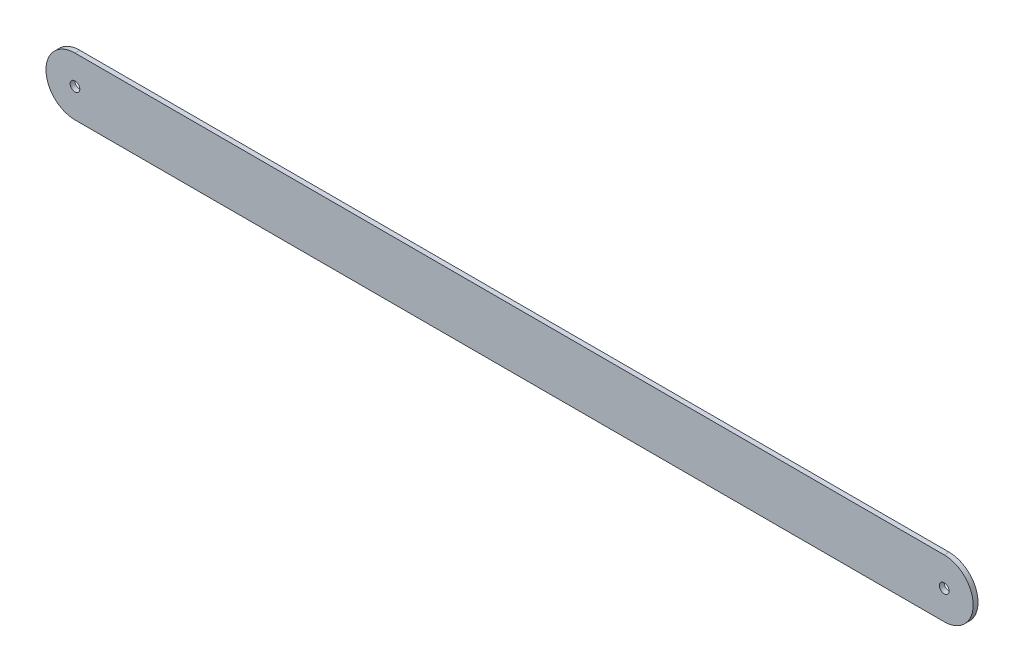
from build123d import *

# Parameters (mm, degrees)
SKETCH2_R           = 1
BOSS_EXTRUDE1_DEPTH = 1


with BuildPart() as part:
    # Sketch2 → Boss-Extrude1 (new body)
    with BuildSketch(Plane.XY):
        with BuildLine():
            Line((0, 6), (180, 6))
            ThreePointArc((180, 6), (186, 0), (180, -6))
            Line((180, -6), (0, -6))
            ThreePointArc((0, -6), (-6, 0), (0, 6))
        make_face()
        Circle(SKETCH2_R, mode=Mode.SUBTRACT)
        with Locations((180, 0)):
            Circle(SKETCH2_R, mode=Mode.SUBTRACT)
    extrude(amount=BOSS_EXTRUDE1_DEPTH)


solid = part.part
